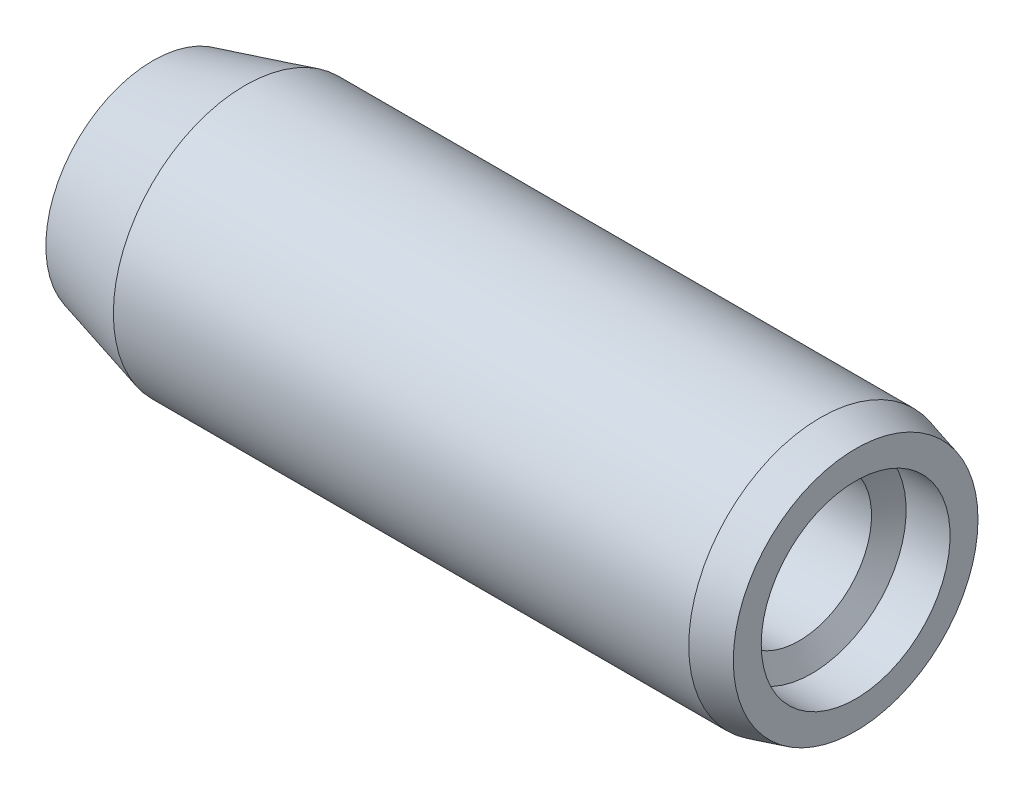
ISO-10303-21;
HEADER;
FILE_DESCRIPTION(('STEP AP214'),'2;1');
FILE_NAME('part.step','',(''),(''),'','','');
FILE_SCHEMA(('AUTOMOTIVE_DESIGN { 1 0 10303 214 1 1 1 1 }'));
ENDSEC;
DATA;
#1=APPLICATION_CONTEXT('core data for automotive mechanical design processes');
#2=APPLICATION_PROTOCOL_DEFINITION('international standard','automotive_design',2000,#1);
#3=PRODUCT_CONTEXT('',#1,'mechanical');
#4=PRODUCT('Part','Part','',(#3));
#5=PRODUCT_RELATED_PRODUCT_CATEGORY('part','',(#4));
#6=PRODUCT_DEFINITION_FORMATION('','',#4);
#7=PRODUCT_DEFINITION_CONTEXT('part definition',#1,'design');
#8=PRODUCT_DEFINITION('design','',#6,#7);
#9=PRODUCT_DEFINITION_SHAPE('','',#8);
#10=(LENGTH_UNIT() NAMED_UNIT(*) SI_UNIT(.MILLI.,.METRE.));
#11=(NAMED_UNIT(*) PLANE_ANGLE_UNIT() SI_UNIT($,.RADIAN.));
#12=(NAMED_UNIT(*) SI_UNIT($,.STERADIAN.) SOLID_ANGLE_UNIT());
#13=UNCERTAINTY_MEASURE_WITH_UNIT(LENGTH_MEASURE(1.E-05),#10,'distance_accuracy_value','');
#14=(GEOMETRIC_REPRESENTATION_CONTEXT(3) GLOBAL_UNCERTAINTY_ASSIGNED_CONTEXT((#13)) GLOBAL_UNIT_ASSIGNED_CONTEXT((#10,
#11,#12)) REPRESENTATION_CONTEXT('',''));
#15=CARTESIAN_POINT('',(0.,0.,0.));
#16=DIRECTION('',(0.,0.,1.));
#17=DIRECTION('',(1.,0.,0.));
#18=AXIS2_PLACEMENT_3D('',#15,#16,#17);
#19=CARTESIAN_POINT('',(16.,2.7856406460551,0.));
#20=DIRECTION('',(-1.,0.,0.));
#21=DIRECTION('',(0.,0.,1.));
#22=AXIS2_PLACEMENT_3D('',#19,#20,#21);
#23=PLANE('',#22);
#24=CARTESIAN_POINT('',(16.,0.,0.));
#25=DIRECTION('',(-1.,0.,0.));
#26=DIRECTION('',(0.,0.,1.));
#27=AXIS2_PLACEMENT_3D('',#24,#25,#26);
#28=CIRCLE('',#27,2.7856406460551);
#29=CARTESIAN_POINT('',(16.,0.,2.7856406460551));
#30=VERTEX_POINT('',#29);
#31=EDGE_CURVE('E11',#30,#30,#28,.T.);
#32=ORIENTED_EDGE('',*,*,#31,.F.);
#33=EDGE_LOOP('',(#32));
#34=FACE_BOUND('',#33,.T.);
#35=CARTESIAN_POINT('',(16.,0.,0.));
#36=DIRECTION('',(-1.,0.,0.));
#37=DIRECTION('',(0.,0.,1.));
#38=AXIS2_PLACEMENT_3D('',#35,#36,#37);
#39=CIRCLE('',#38,2.15);
#40=CARTESIAN_POINT('',(16.,0.,2.15));
#41=VERTEX_POINT('',#40);
#42=EDGE_CURVE('E48',#41,#41,#39,.F.);
#43=ORIENTED_EDGE('',*,*,#42,.F.);
#44=EDGE_LOOP('',(#43));
#45=FACE_BOUND('',#44,.T.);
#46=ADVANCED_FACE('F44',(#34,#45),#23,.F.);
#47=CARTESIAN_POINT('',(16.,0.,0.));
#48=DIRECTION('',(-1.,0.,0.));
#49=DIRECTION('',(0.,0.,1.));
#50=AXIS2_PLACEMENT_3D('',#47,#48,#49);
#51=CONICAL_SURFACE('',#50,2.7856406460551,0.261799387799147);
#52=CARTESIAN_POINT('',(15.2,0.,0.));
#53=DIRECTION('',(-1.,0.,0.));
#54=DIRECTION('',(0.,0.,1.));
#55=AXIS2_PLACEMENT_3D('',#52,#53,#54);
#56=CIRCLE('',#55,3.);
#57=CARTESIAN_POINT('',(15.2,0.,3.));
#58=VERTEX_POINT('',#57);
#59=EDGE_CURVE('E52',#58,#58,#56,.T.);
#60=ORIENTED_EDGE('',*,*,#59,.F.);
#61=EDGE_LOOP('',(#60));
#62=FACE_BOUND('',#61,.T.);
#63=ORIENTED_EDGE('',*,*,#31,.T.);
#64=EDGE_LOOP('',(#63));
#65=FACE_BOUND('',#64,.T.);
#66=ADVANCED_FACE('F90',(#62,#65),#51,.T.);
#67=CARTESIAN_POINT('',(-3.86247654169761,0.,0.));
#68=DIRECTION('',(-1.,0.,0.));
#69=DIRECTION('',(0.,0.,1.));
#70=AXIS2_PLACEMENT_3D('',#67,#68,#69);
#71=CYLINDRICAL_SURFACE('',#70,3.);
#72=CARTESIAN_POINT('',(2.1,0.,0.));
#73=DIRECTION('',(-1.,0.,0.));
#74=DIRECTION('',(0.,0.,1.));
#75=AXIS2_PLACEMENT_3D('',#72,#73,#74);
#76=CIRCLE('',#75,3.);
#77=CARTESIAN_POINT('',(2.1,0.,3.));
#78=VERTEX_POINT('',#77);
#79=EDGE_CURVE('E79',#78,#78,#76,.T.);
#80=ORIENTED_EDGE('',*,*,#79,.F.);
#81=EDGE_LOOP('',(#80));
#82=FACE_BOUND('',#81,.T.);
#83=ORIENTED_EDGE('',*,*,#59,.T.);
#84=EDGE_LOOP('',(#83));
#85=FACE_BOUND('',#84,.T.);
#86=ADVANCED_FACE('F81',(#82,#85),#71,.T.);
#87=CARTESIAN_POINT('',(2.1,0.,0.));
#88=DIRECTION('',(1.,0.,0.));
#89=DIRECTION('',(0.,0.,-1.));
#90=AXIS2_PLACEMENT_3D('',#87,#88,#89);
#91=CONICAL_SURFACE('',#90,3.,0.26179938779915);
#92=ORIENTED_EDGE('',*,*,#79,.T.);
#93=EDGE_LOOP('',(#92));
#94=FACE_BOUND('',#93,.T.);
#95=CARTESIAN_POINT('',(0.,0.,0.));
#96=DIRECTION('',(1.,0.,0.));
#97=DIRECTION('',(0.,1.,0.));
#98=AXIS2_PLACEMENT_3D('',#95,#96,#97);
#99=CIRCLE('',#98,2.43730669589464);
#100=CARTESIAN_POINT('',(0.,2.43730669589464,0.));
#101=VERTEX_POINT('',#100);
#102=EDGE_CURVE('E77',#101,#101,#99,.T.);
#103=ORIENTED_EDGE('',*,*,#102,.T.);
#104=EDGE_LOOP('',(#103));
#105=FACE_BOUND('',#104,.T.);
#106=ADVANCED_FACE('F107',(#94,#105),#91,.T.);
#107=CARTESIAN_POINT('',(0.,0.,0.));
#108=DIRECTION('',(-1.,0.,0.));
#109=DIRECTION('',(0.,-1.,0.));
#110=AXIS2_PLACEMENT_3D('',#107,#108,#109);
#111=PLANE('',#110);
#112=CARTESIAN_POINT('',(0.,0.,0.));
#113=VERTEX_POINT('',#112);
#114=VERTEX_LOOP('',#113);
#115=FACE_BOUND('',#114,.T.);
#116=ORIENTED_EDGE('',*,*,#102,.F.);
#117=EDGE_LOOP('',(#116));
#118=FACE_BOUND('',#117,.T.);
#119=ADVANCED_FACE('F99',(#115,#118),#111,.T.);
#120=CARTESIAN_POINT('',(16.,0.,0.));
#121=DIRECTION('',(-1.,0.,0.));
#122=DIRECTION('',(0.,0.,1.));
#123=AXIS2_PLACEMENT_3D('',#120,#121,#122);
#124=CYLINDRICAL_SURFACE('',#123,2.15);
#125=CARTESIAN_POINT('',(15.,0.,0.));
#126=DIRECTION('',(-1.,0.,0.));
#127=DIRECTION('',(0.,0.,1.));
#128=AXIS2_PLACEMENT_3D('',#125,#126,#127);
#129=CIRCLE('',#128,2.15);
#130=CARTESIAN_POINT('',(15.,0.,2.15));
#131=VERTEX_POINT('',#130);
#132=EDGE_CURVE('E73',#131,#131,#129,.T.);
#133=ORIENTED_EDGE('',*,*,#132,.T.);
#134=EDGE_LOOP('',(#133));
#135=FACE_BOUND('',#134,.T.);
#136=ORIENTED_EDGE('',*,*,#42,.T.);
#137=EDGE_LOOP('',(#136));
#138=FACE_BOUND('',#137,.T.);
#139=ADVANCED_FACE('F97',(#135,#138),#124,.F.);
#140=CARTESIAN_POINT('',(15.,0.,0.));
#141=DIRECTION('',(1.,0.,0.));
#142=DIRECTION('',(0.,0.,-1.));
#143=AXIS2_PLACEMENT_3D('',#140,#141,#142);
#144=CONICAL_SURFACE('',#143,2.15,1.0471975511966);
#145=CARTESIAN_POINT('',(14.7113248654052,0.,0.));
#146=DIRECTION('',(-1.,0.,0.));
#147=DIRECTION('',(0.,0.,1.));
#148=AXIS2_PLACEMENT_3D('',#145,#146,#147);
#149=CIRCLE('',#148,1.65);
#150=CARTESIAN_POINT('',(14.7113248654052,0.,1.65));
#151=VERTEX_POINT('',#150);
#152=EDGE_CURVE('E67',#151,#151,#149,.T.);
#153=ORIENTED_EDGE('',*,*,#152,.T.);
#154=EDGE_LOOP('',(#153));
#155=FACE_BOUND('',#154,.T.);
#156=ORIENTED_EDGE('',*,*,#132,.F.);
#157=EDGE_LOOP('',(#156));
#158=FACE_BOUND('',#157,.T.);
#159=ADVANCED_FACE('F100',(#155,#158),#144,.F.);
#160=CARTESIAN_POINT('',(16.,0.,0.));
#161=DIRECTION('',(-1.,0.,0.));
#162=DIRECTION('',(0.,0.,1.));
#163=AXIS2_PLACEMENT_3D('',#160,#161,#162);
#164=CYLINDRICAL_SURFACE('',#163,1.65);
#165=CARTESIAN_POINT('',(6.,0.,0.));
#166=DIRECTION('',(-1.,0.,0.));
#167=DIRECTION('',(0.,0.,1.));
#168=AXIS2_PLACEMENT_3D('',#165,#166,#167);
#169=CIRCLE('',#168,1.65);
#170=CARTESIAN_POINT('',(6.,0.,1.65));
#171=VERTEX_POINT('',#170);
#172=EDGE_CURVE('E66',#171,#171,#169,.T.);
#173=ORIENTED_EDGE('',*,*,#172,.T.);
#174=EDGE_LOOP('',(#173));
#175=FACE_BOUND('',#174,.T.);
#176=ORIENTED_EDGE('',*,*,#152,.F.);
#177=EDGE_LOOP('',(#176));
#178=FACE_BOUND('',#177,.T.);
#179=ADVANCED_FACE('F64',(#175,#178),#164,.F.);
#180=CARTESIAN_POINT('',(6.,0.,0.));
#181=DIRECTION('',(1.,0.,0.));
#182=DIRECTION('',(0.,0.,-1.));
#183=AXIS2_PLACEMENT_3D('',#180,#181,#182);
#184=CONICAL_SURFACE('',#183,1.65,1.04719755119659);
#185=CARTESIAN_POINT('',(5.04737205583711,0.,0.));
#186=VERTEX_POINT('',#185);
#187=VERTEX_LOOP('',#186);
#188=FACE_BOUND('',#187,.T.);
#189=ORIENTED_EDGE('',*,*,#172,.F.);
#190=EDGE_LOOP('',(#189));
#191=FACE_BOUND('',#190,.T.);
#192=ADVANCED_FACE('F56',(#188,#191),#184,.F.);
#193=CLOSED_SHELL('',(#46,#66,#86,#106,#119,#139,#159,#179,#192));
#194=MANIFOLD_SOLID_BREP('B2',#193);
#195=ADVANCED_BREP_SHAPE_REPRESENTATION('',(#18,#194),#14);
#196=SHAPE_DEFINITION_REPRESENTATION(#9,#195);
ENDSEC;
END-ISO-10303-21;
